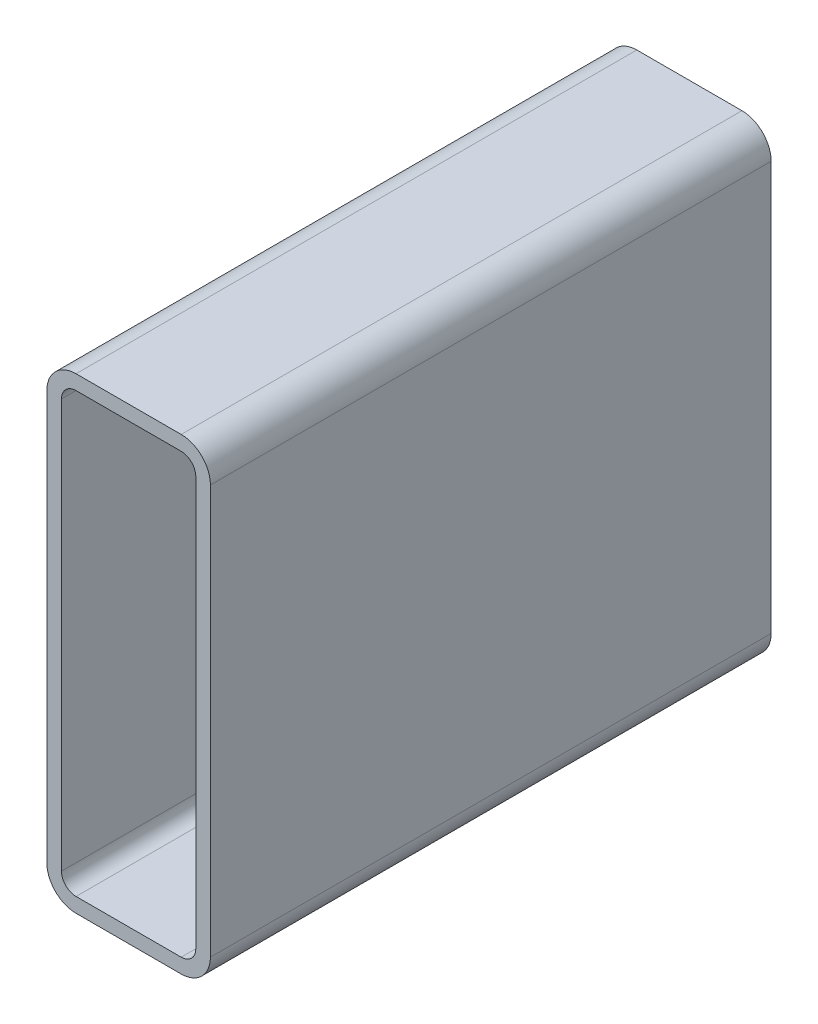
ISO-10303-21;
HEADER;
FILE_DESCRIPTION(('STEP AP214'),'2;1');
FILE_NAME('part.step','',(''),(''),'','','');
FILE_SCHEMA(('AUTOMOTIVE_DESIGN { 1 0 10303 214 1 1 1 1 }'));
ENDSEC;
DATA;
#1=APPLICATION_CONTEXT('core data for automotive mechanical design processes');
#2=APPLICATION_PROTOCOL_DEFINITION('international standard','automotive_design',2000,#1);
#3=PRODUCT_CONTEXT('',#1,'mechanical');
#4=PRODUCT('Part','Part','',(#3));
#5=PRODUCT_RELATED_PRODUCT_CATEGORY('part','',(#4));
#6=PRODUCT_DEFINITION_FORMATION('','',#4);
#7=PRODUCT_DEFINITION_CONTEXT('part definition',#1,'design');
#8=PRODUCT_DEFINITION('design','',#6,#7);
#9=PRODUCT_DEFINITION_SHAPE('','',#8);
#10=(LENGTH_UNIT() NAMED_UNIT(*) SI_UNIT(.MILLI.,.METRE.));
#11=(NAMED_UNIT(*) PLANE_ANGLE_UNIT() SI_UNIT($,.RADIAN.));
#12=(NAMED_UNIT(*) SI_UNIT($,.STERADIAN.) SOLID_ANGLE_UNIT());
#13=UNCERTAINTY_MEASURE_WITH_UNIT(LENGTH_MEASURE(1.E-05),#10,'distance_accuracy_value','');
#14=(GEOMETRIC_REPRESENTATION_CONTEXT(3) GLOBAL_UNCERTAINTY_ASSIGNED_CONTEXT((#13)) GLOBAL_UNIT_ASSIGNED_CONTEXT((#10,
#11,#12)) REPRESENTATION_CONTEXT('',''));
#15=CARTESIAN_POINT('',(0.,0.,0.));
#16=DIRECTION('',(0.,0.,1.));
#17=DIRECTION('',(1.,0.,0.));
#18=AXIS2_PLACEMENT_3D('',#15,#16,#17);
#19=CARTESIAN_POINT('',(17.9571469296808,240.045313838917,304.8));
#20=DIRECTION('',(0.,0.,1.));
#21=DIRECTION('',(1.,0.,0.));
#22=AXIS2_PLACEMENT_3D('',#19,#20,#21);
#23=PLANE('',#22);
#24=CARTESIAN_POINT('',(17.9571469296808,240.045313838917,304.8));
#25=DIRECTION('',(0.,0.,1.));
#26=DIRECTION('',(1.,0.,0.));
#27=AXIS2_PLACEMENT_3D('',#24,#25,#26);
#28=CIRCLE('',#27,15.875);
#29=CARTESIAN_POINT('',(17.9571469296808,255.920313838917,304.8));
#30=VERTEX_POINT('',#29);
#31=CARTESIAN_POINT('',(2.08214692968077,240.045313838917,304.8));
#32=VERTEX_POINT('',#31);
#33=EDGE_CURVE('E211',#30,#32,#28,.T.);
#34=ORIENTED_EDGE('',*,*,#33,.T.);
#35=DIRECTION('',(0.,-1.,0.));
#36=VECTOR('',#35,1.);
#37=CARTESIAN_POINT('',(2.08214692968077,17.7953138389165,304.8));
#38=LINE('',#37,#36);
#39=CARTESIAN_POINT('',(2.08214692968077,17.7953138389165,304.8));
#40=VERTEX_POINT('',#39);
#41=EDGE_CURVE('E214',#32,#40,#38,.T.);
#42=ORIENTED_EDGE('',*,*,#41,.T.);
#43=CARTESIAN_POINT('',(17.9571469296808,17.7953138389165,304.8));
#44=DIRECTION('',(0.,0.,1.));
#45=DIRECTION('',(1.,0.,0.));
#46=AXIS2_PLACEMENT_3D('',#43,#44,#45);
#47=CIRCLE('',#46,15.875);
#48=CARTESIAN_POINT('',(17.9571469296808,1.92031383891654,304.8));
#49=VERTEX_POINT('',#48);
#50=EDGE_CURVE('E217',#40,#49,#47,.T.);
#51=ORIENTED_EDGE('',*,*,#50,.T.);
#52=DIRECTION('',(1.,0.,0.));
#53=VECTOR('',#52,1.);
#54=CARTESIAN_POINT('',(75.1071469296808,1.92031383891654,304.8));
#55=LINE('',#54,#53);
#56=CARTESIAN_POINT('',(75.1071469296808,1.92031383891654,304.8));
#57=VERTEX_POINT('',#56);
#58=EDGE_CURVE('E219',#49,#57,#55,.T.);
#59=ORIENTED_EDGE('',*,*,#58,.T.);
#60=CARTESIAN_POINT('',(75.1071469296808,17.7953138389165,304.8));
#61=DIRECTION('',(0.,0.,1.));
#62=DIRECTION('',(1.,0.,0.));
#63=AXIS2_PLACEMENT_3D('',#60,#61,#62);
#64=CIRCLE('',#63,15.875);
#65=CARTESIAN_POINT('',(90.9821469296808,17.7953138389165,304.8));
#66=VERTEX_POINT('',#65);
#67=EDGE_CURVE('E221',#57,#66,#64,.T.);
#68=ORIENTED_EDGE('',*,*,#67,.T.);
#69=DIRECTION('',(0.,1.,0.));
#70=VECTOR('',#69,1.);
#71=CARTESIAN_POINT('',(90.9821469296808,240.045313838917,304.8));
#72=LINE('',#71,#70);
#73=CARTESIAN_POINT('',(90.9821469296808,240.045313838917,304.8));
#74=VERTEX_POINT('',#73);
#75=EDGE_CURVE('E223',#66,#74,#72,.T.);
#76=ORIENTED_EDGE('',*,*,#75,.T.);
#77=CARTESIAN_POINT('',(75.1071469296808,240.045313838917,304.8));
#78=DIRECTION('',(0.,0.,1.));
#79=DIRECTION('',(1.,0.,0.));
#80=AXIS2_PLACEMENT_3D('',#77,#78,#79);
#81=CIRCLE('',#80,15.875);
#82=CARTESIAN_POINT('',(75.1071469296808,255.920313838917,304.8));
#83=VERTEX_POINT('',#82);
#84=EDGE_CURVE('E225',#74,#83,#81,.T.);
#85=ORIENTED_EDGE('',*,*,#84,.T.);
#86=DIRECTION('',(-1.,0.,0.));
#87=VECTOR('',#86,1.);
#88=CARTESIAN_POINT('',(17.9571469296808,255.920313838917,304.8));
#89=LINE('',#88,#87);
#90=EDGE_CURVE('E227',#83,#30,#89,.T.);
#91=ORIENTED_EDGE('',*,*,#90,.T.);
#92=EDGE_LOOP('',(#34,#42,#51,#59,#68,#76,#85,#91));
#93=FACE_BOUND('',#92,.T.);
#94=DIRECTION('',(0.,-1.,0.));
#95=VECTOR('',#94,1.);
#96=CARTESIAN_POINT('',(10.0196469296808,17.7953138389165,304.8));
#97=LINE('',#96,#95);
#98=CARTESIAN_POINT('',(10.0196469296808,240.045313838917,304.8));
#99=VERTEX_POINT('',#98);
#100=CARTESIAN_POINT('',(10.0196469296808,17.7953138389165,304.8));
#101=VERTEX_POINT('',#100);
#102=EDGE_CURVE('E154',#99,#101,#97,.T.);
#103=ORIENTED_EDGE('',*,*,#102,.F.);
#104=CARTESIAN_POINT('',(17.9571469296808,240.045313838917,304.8));
#105=DIRECTION('',(0.,0.,1.));
#106=DIRECTION('',(1.,0.,0.));
#107=AXIS2_PLACEMENT_3D('',#104,#105,#106);
#108=CIRCLE('',#107,7.9375);
#109=CARTESIAN_POINT('',(17.9571469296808,247.982813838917,304.8));
#110=VERTEX_POINT('',#109);
#111=EDGE_CURVE('E146',#110,#99,#108,.T.);
#112=ORIENTED_EDGE('',*,*,#111,.F.);
#113=DIRECTION('',(-1.,0.,0.));
#114=VECTOR('',#113,1.);
#115=CARTESIAN_POINT('',(17.9571469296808,247.982813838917,304.8));
#116=LINE('',#115,#114);
#117=CARTESIAN_POINT('',(75.1071469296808,247.982813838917,304.8));
#118=VERTEX_POINT('',#117);
#119=EDGE_CURVE('E179',#118,#110,#116,.T.);
#120=ORIENTED_EDGE('',*,*,#119,.F.);
#121=CARTESIAN_POINT('',(75.1071469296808,240.045313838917,304.8));
#122=DIRECTION('',(0.,0.,1.));
#123=DIRECTION('',(1.,0.,0.));
#124=AXIS2_PLACEMENT_3D('',#121,#122,#123);
#125=CIRCLE('',#124,7.93749999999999);
#126=CARTESIAN_POINT('',(83.0446469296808,240.045313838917,304.8));
#127=VERTEX_POINT('',#126);
#128=EDGE_CURVE('E177',#127,#118,#125,.T.);
#129=ORIENTED_EDGE('',*,*,#128,.F.);
#130=DIRECTION('',(0.,1.,0.));
#131=VECTOR('',#130,1.);
#132=CARTESIAN_POINT('',(83.0446469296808,240.045313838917,304.8));
#133=LINE('',#132,#131);
#134=CARTESIAN_POINT('',(83.0446469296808,17.7953138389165,304.8));
#135=VERTEX_POINT('',#134);
#136=EDGE_CURVE('E175',#135,#127,#133,.T.);
#137=ORIENTED_EDGE('',*,*,#136,.F.);
#138=CARTESIAN_POINT('',(75.1071469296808,17.7953138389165,304.8));
#139=DIRECTION('',(0.,0.,1.));
#140=DIRECTION('',(1.,0.,0.));
#141=AXIS2_PLACEMENT_3D('',#138,#139,#140);
#142=CIRCLE('',#141,7.9375);
#143=CARTESIAN_POINT('',(75.1071469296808,9.85781383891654,304.8));
#144=VERTEX_POINT('',#143);
#145=EDGE_CURVE('E173',#144,#135,#142,.T.);
#146=ORIENTED_EDGE('',*,*,#145,.F.);
#147=DIRECTION('',(1.,0.,0.));
#148=VECTOR('',#147,1.);
#149=CARTESIAN_POINT('',(75.1071469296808,9.85781383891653,304.8));
#150=LINE('',#149,#148);
#151=CARTESIAN_POINT('',(17.9571469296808,9.85781383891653,304.8));
#152=VERTEX_POINT('',#151);
#153=EDGE_CURVE('E169',#152,#144,#150,.T.);
#154=ORIENTED_EDGE('',*,*,#153,.F.);
#155=CARTESIAN_POINT('',(17.9571469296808,17.7953138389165,304.8));
#156=DIRECTION('',(0.,0.,1.));
#157=DIRECTION('',(1.,0.,0.));
#158=AXIS2_PLACEMENT_3D('',#155,#156,#157);
#159=CIRCLE('',#158,7.9375);
#160=EDGE_CURVE('E167',#101,#152,#159,.T.);
#161=ORIENTED_EDGE('',*,*,#160,.F.);
#162=EDGE_LOOP('',(#103,#112,#120,#129,#137,#146,#154,#161));
#163=FACE_BOUND('',#162,.T.);
#164=ADVANCED_FACE('F33',(#93,#163),#23,.T.);
#165=CARTESIAN_POINT('',(17.9571469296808,240.045313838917,0.));
#166=DIRECTION('',(0.,0.,1.));
#167=DIRECTION('',(1.,0.,0.));
#168=AXIS2_PLACEMENT_3D('',#165,#166,#167);
#169=PLANE('',#168);
#170=CARTESIAN_POINT('',(17.9571469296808,240.045313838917,0.));
#171=DIRECTION('',(0.,0.,1.));
#172=DIRECTION('',(1.,0.,0.));
#173=AXIS2_PLACEMENT_3D('',#170,#171,#172);
#174=CIRCLE('',#173,15.875);
#175=CARTESIAN_POINT('',(17.9571469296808,255.920313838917,0.));
#176=VERTEX_POINT('',#175);
#177=CARTESIAN_POINT('',(2.08214692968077,240.045313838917,0.));
#178=VERTEX_POINT('',#177);
#179=EDGE_CURVE('E162',#176,#178,#174,.T.);
#180=ORIENTED_EDGE('',*,*,#179,.F.);
#181=DIRECTION('',(-1.,0.,0.));
#182=VECTOR('',#181,1.);
#183=CARTESIAN_POINT('',(17.9571469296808,255.920313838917,0.));
#184=LINE('',#183,#182);
#185=CARTESIAN_POINT('',(75.1071469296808,255.920313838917,0.));
#186=VERTEX_POINT('',#185);
#187=EDGE_CURVE('E215',#186,#176,#184,.T.);
#188=ORIENTED_EDGE('',*,*,#187,.F.);
#189=CARTESIAN_POINT('',(75.1071469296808,240.045313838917,0.));
#190=DIRECTION('',(0.,0.,1.));
#191=DIRECTION('',(1.,0.,0.));
#192=AXIS2_PLACEMENT_3D('',#189,#190,#191);
#193=CIRCLE('',#192,15.875);
#194=CARTESIAN_POINT('',(90.9821469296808,240.045313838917,0.));
#195=VERTEX_POINT('',#194);
#196=EDGE_CURVE('E242',#195,#186,#193,.T.);
#197=ORIENTED_EDGE('',*,*,#196,.F.);
#198=DIRECTION('',(0.,1.,0.));
#199=VECTOR('',#198,1.);
#200=CARTESIAN_POINT('',(90.9821469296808,240.045313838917,0.));
#201=LINE('',#200,#199);
#202=CARTESIAN_POINT('',(90.9821469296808,17.7953138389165,0.));
#203=VERTEX_POINT('',#202);
#204=EDGE_CURVE('E240',#203,#195,#201,.T.);
#205=ORIENTED_EDGE('',*,*,#204,.F.);
#206=CARTESIAN_POINT('',(75.1071469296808,17.7953138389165,0.));
#207=DIRECTION('',(0.,0.,1.));
#208=DIRECTION('',(1.,0.,0.));
#209=AXIS2_PLACEMENT_3D('',#206,#207,#208);
#210=CIRCLE('',#209,15.875);
#211=CARTESIAN_POINT('',(75.1071469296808,1.92031383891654,0.));
#212=VERTEX_POINT('',#211);
#213=EDGE_CURVE('E238',#212,#203,#210,.T.);
#214=ORIENTED_EDGE('',*,*,#213,.F.);
#215=DIRECTION('',(1.,0.,0.));
#216=VECTOR('',#215,1.);
#217=CARTESIAN_POINT('',(75.1071469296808,1.92031383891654,0.));
#218=LINE('',#217,#216);
#219=CARTESIAN_POINT('',(17.9571469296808,1.92031383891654,0.));
#220=VERTEX_POINT('',#219);
#221=EDGE_CURVE('E236',#220,#212,#218,.T.);
#222=ORIENTED_EDGE('',*,*,#221,.F.);
#223=CARTESIAN_POINT('',(17.9571469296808,17.7953138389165,0.));
#224=DIRECTION('',(0.,0.,1.));
#225=DIRECTION('',(1.,0.,0.));
#226=AXIS2_PLACEMENT_3D('',#223,#224,#225);
#227=CIRCLE('',#226,15.875);
#228=CARTESIAN_POINT('',(2.08214692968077,17.7953138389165,0.));
#229=VERTEX_POINT('',#228);
#230=EDGE_CURVE('E234',#229,#220,#227,.T.);
#231=ORIENTED_EDGE('',*,*,#230,.F.);
#232=DIRECTION('',(0.,-1.,0.));
#233=VECTOR('',#232,1.);
#234=CARTESIAN_POINT('',(2.08214692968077,17.7953138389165,0.));
#235=LINE('',#234,#233);
#236=EDGE_CURVE('E232',#178,#229,#235,.T.);
#237=ORIENTED_EDGE('',*,*,#236,.F.);
#238=EDGE_LOOP('',(#180,#188,#197,#205,#214,#222,#231,#237));
#239=FACE_BOUND('',#238,.T.);
#240=CARTESIAN_POINT('',(17.9571469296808,240.045313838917,0.));
#241=DIRECTION('',(0.,0.,1.));
#242=DIRECTION('',(1.,0.,0.));
#243=AXIS2_PLACEMENT_3D('',#240,#241,#242);
#244=CIRCLE('',#243,7.9375);
#245=CARTESIAN_POINT('',(17.9571469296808,247.982813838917,0.));
#246=VERTEX_POINT('',#245);
#247=CARTESIAN_POINT('',(10.0196469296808,240.045313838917,0.));
#248=VERTEX_POINT('',#247);
#249=EDGE_CURVE('E56',#246,#248,#244,.T.);
#250=ORIENTED_EDGE('',*,*,#249,.T.);
#251=DIRECTION('',(0.,-1.,0.));
#252=VECTOR('',#251,1.);
#253=CARTESIAN_POINT('',(10.0196469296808,17.7953138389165,0.));
#254=LINE('',#253,#252);
#255=CARTESIAN_POINT('',(10.0196469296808,17.7953138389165,0.));
#256=VERTEX_POINT('',#255);
#257=EDGE_CURVE('E161',#248,#256,#254,.T.);
#258=ORIENTED_EDGE('',*,*,#257,.T.);
#259=CARTESIAN_POINT('',(17.9571469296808,17.7953138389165,0.));
#260=DIRECTION('',(0.,0.,1.));
#261=DIRECTION('',(1.,0.,0.));
#262=AXIS2_PLACEMENT_3D('',#259,#260,#261);
#263=CIRCLE('',#262,7.9375);
#264=CARTESIAN_POINT('',(17.9571469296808,9.85781383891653,0.));
#265=VERTEX_POINT('',#264);
#266=EDGE_CURVE('E183',#256,#265,#263,.T.);
#267=ORIENTED_EDGE('',*,*,#266,.T.);
#268=DIRECTION('',(1.,0.,0.));
#269=VECTOR('',#268,1.);
#270=CARTESIAN_POINT('',(75.1071469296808,9.85781383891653,0.));
#271=LINE('',#270,#269);
#272=CARTESIAN_POINT('',(75.1071469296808,9.85781383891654,0.));
#273=VERTEX_POINT('',#272);
#274=EDGE_CURVE('E186',#265,#273,#271,.T.);
#275=ORIENTED_EDGE('',*,*,#274,.T.);
#276=CARTESIAN_POINT('',(75.1071469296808,17.7953138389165,0.));
#277=DIRECTION('',(0.,0.,1.));
#278=DIRECTION('',(1.,0.,0.));
#279=AXIS2_PLACEMENT_3D('',#276,#277,#278);
#280=CIRCLE('',#279,7.9375);
#281=CARTESIAN_POINT('',(83.0446469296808,17.7953138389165,0.));
#282=VERTEX_POINT('',#281);
#283=EDGE_CURVE('E189',#273,#282,#280,.T.);
#284=ORIENTED_EDGE('',*,*,#283,.T.);
#285=DIRECTION('',(0.,1.,0.));
#286=VECTOR('',#285,1.);
#287=CARTESIAN_POINT('',(83.0446469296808,240.045313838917,0.));
#288=LINE('',#287,#286);
#289=CARTESIAN_POINT('',(83.0446469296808,240.045313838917,0.));
#290=VERTEX_POINT('',#289);
#291=EDGE_CURVE('E192',#282,#290,#288,.T.);
#292=ORIENTED_EDGE('',*,*,#291,.T.);
#293=CARTESIAN_POINT('',(75.1071469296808,240.045313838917,0.));
#294=DIRECTION('',(0.,0.,1.));
#295=DIRECTION('',(1.,0.,0.));
#296=AXIS2_PLACEMENT_3D('',#293,#294,#295);
#297=CIRCLE('',#296,7.93749999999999);
#298=CARTESIAN_POINT('',(75.1071469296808,247.982813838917,0.));
#299=VERTEX_POINT('',#298);
#300=EDGE_CURVE('E195',#290,#299,#297,.T.);
#301=ORIENTED_EDGE('',*,*,#300,.T.);
#302=DIRECTION('',(-1.,0.,0.));
#303=VECTOR('',#302,1.);
#304=CARTESIAN_POINT('',(17.9571469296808,247.982813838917,0.));
#305=LINE('',#304,#303);
#306=EDGE_CURVE('E155',#299,#246,#305,.T.);
#307=ORIENTED_EDGE('',*,*,#306,.T.);
#308=EDGE_LOOP('',(#250,#258,#267,#275,#284,#292,#301,#307));
#309=FACE_BOUND('',#308,.T.);
#310=ADVANCED_FACE('F272',(#239,#309),#169,.F.);
#311=CARTESIAN_POINT('',(17.9571469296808,240.045313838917,304.8));
#312=DIRECTION('',(0.,0.,-1.));
#313=DIRECTION('',(-1.,0.,0.));
#314=AXIS2_PLACEMENT_3D('',#311,#312,#313);
#315=CYLINDRICAL_SURFACE('',#314,15.875);
#316=ORIENTED_EDGE('',*,*,#179,.T.);
#317=DIRECTION('',(0.,0.,-1.));
#318=VECTOR('',#317,1.);
#319=CARTESIAN_POINT('',(2.08214692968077,240.045313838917,304.8));
#320=LINE('',#319,#318);
#321=EDGE_CURVE('E11',#32,#178,#320,.T.);
#322=ORIENTED_EDGE('',*,*,#321,.F.);
#323=ORIENTED_EDGE('',*,*,#33,.F.);
#324=DIRECTION('',(0.,0.,-1.));
#325=VECTOR('',#324,1.);
#326=CARTESIAN_POINT('',(17.9571469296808,255.920313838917,304.8));
#327=LINE('',#326,#325);
#328=EDGE_CURVE('E229',#30,#176,#327,.T.);
#329=ORIENTED_EDGE('',*,*,#328,.T.);
#330=EDGE_LOOP('',(#316,#322,#323,#329));
#331=FACE_BOUND('',#330,.T.);
#332=ADVANCED_FACE('F35',(#331),#315,.T.);
#333=CARTESIAN_POINT('',(2.08214692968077,17.7953138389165,304.8));
#334=DIRECTION('',(1.,0.,0.));
#335=DIRECTION('',(0.,0.,-1.));
#336=AXIS2_PLACEMENT_3D('',#333,#334,#335);
#337=PLANE('',#336);
#338=ORIENTED_EDGE('',*,*,#236,.T.);
#339=DIRECTION('',(0.,0.,-1.));
#340=VECTOR('',#339,1.);
#341=CARTESIAN_POINT('',(2.08214692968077,17.7953138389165,304.8));
#342=LINE('',#341,#340);
#343=EDGE_CURVE('E41',#40,#229,#342,.T.);
#344=ORIENTED_EDGE('',*,*,#343,.F.);
#345=ORIENTED_EDGE('',*,*,#41,.F.);
#346=ORIENTED_EDGE('',*,*,#321,.T.);
#347=EDGE_LOOP('',(#338,#344,#345,#346));
#348=FACE_BOUND('',#347,.T.);
#349=ADVANCED_FACE('F289',(#348),#337,.F.);
#350=CARTESIAN_POINT('',(17.9571469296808,17.7953138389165,304.8));
#351=DIRECTION('',(0.,0.,-1.));
#352=DIRECTION('',(-1.,0.,0.));
#353=AXIS2_PLACEMENT_3D('',#350,#351,#352);
#354=CYLINDRICAL_SURFACE('',#353,15.875);
#355=ORIENTED_EDGE('',*,*,#230,.T.);
#356=DIRECTION('',(0.,0.,-1.));
#357=VECTOR('',#356,1.);
#358=CARTESIAN_POINT('',(17.9571469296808,1.92031383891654,304.8));
#359=LINE('',#358,#357);
#360=EDGE_CURVE('E259',#49,#220,#359,.T.);
#361=ORIENTED_EDGE('',*,*,#360,.F.);
#362=ORIENTED_EDGE('',*,*,#50,.F.);
#363=ORIENTED_EDGE('',*,*,#343,.T.);
#364=EDGE_LOOP('',(#355,#361,#362,#363));
#365=FACE_BOUND('',#364,.T.);
#366=ADVANCED_FACE('F266',(#365),#354,.T.);
#367=CARTESIAN_POINT('',(75.1071469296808,1.92031383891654,304.8));
#368=DIRECTION('',(0.,1.,0.));
#369=DIRECTION('',(0.,0.,1.));
#370=AXIS2_PLACEMENT_3D('',#367,#368,#369);
#371=PLANE('',#370);
#372=ORIENTED_EDGE('',*,*,#221,.T.);
#373=DIRECTION('',(0.,0.,-1.));
#374=VECTOR('',#373,1.);
#375=CARTESIAN_POINT('',(75.1071469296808,1.92031383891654,304.8));
#376=LINE('',#375,#374);
#377=EDGE_CURVE('E256',#57,#212,#376,.T.);
#378=ORIENTED_EDGE('',*,*,#377,.F.);
#379=ORIENTED_EDGE('',*,*,#58,.F.);
#380=ORIENTED_EDGE('',*,*,#360,.T.);
#381=EDGE_LOOP('',(#372,#378,#379,#380));
#382=FACE_BOUND('',#381,.T.);
#383=ADVANCED_FACE('F278',(#382),#371,.F.);
#384=CARTESIAN_POINT('',(75.1071469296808,17.7953138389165,304.8));
#385=DIRECTION('',(0.,0.,-1.));
#386=DIRECTION('',(-1.,0.,0.));
#387=AXIS2_PLACEMENT_3D('',#384,#385,#386);
#388=CYLINDRICAL_SURFACE('',#387,15.875);
#389=ORIENTED_EDGE('',*,*,#213,.T.);
#390=DIRECTION('',(0.,0.,-1.));
#391=VECTOR('',#390,1.);
#392=CARTESIAN_POINT('',(90.9821469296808,17.7953138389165,304.8));
#393=LINE('',#392,#391);
#394=EDGE_CURVE('E253',#66,#203,#393,.T.);
#395=ORIENTED_EDGE('',*,*,#394,.F.);
#396=ORIENTED_EDGE('',*,*,#67,.F.);
#397=ORIENTED_EDGE('',*,*,#377,.T.);
#398=EDGE_LOOP('',(#389,#395,#396,#397));
#399=FACE_BOUND('',#398,.T.);
#400=ADVANCED_FACE('F282',(#399),#388,.T.);
#401=CARTESIAN_POINT('',(90.9821469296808,240.045313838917,304.8));
#402=DIRECTION('',(-1.,0.,0.));
#403=DIRECTION('',(0.,0.,1.));
#404=AXIS2_PLACEMENT_3D('',#401,#402,#403);
#405=PLANE('',#404);
#406=ORIENTED_EDGE('',*,*,#204,.T.);
#407=DIRECTION('',(0.,0.,-1.));
#408=VECTOR('',#407,1.);
#409=CARTESIAN_POINT('',(90.9821469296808,240.045313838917,304.8));
#410=LINE('',#409,#408);
#411=EDGE_CURVE('E250',#74,#195,#410,.T.);
#412=ORIENTED_EDGE('',*,*,#411,.F.);
#413=ORIENTED_EDGE('',*,*,#75,.F.);
#414=ORIENTED_EDGE('',*,*,#394,.T.);
#415=EDGE_LOOP('',(#406,#412,#413,#414));
#416=FACE_BOUND('',#415,.T.);
#417=ADVANCED_FACE('F302',(#416),#405,.F.);
#418=CARTESIAN_POINT('',(75.1071469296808,240.045313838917,304.8));
#419=DIRECTION('',(0.,0.,-1.));
#420=DIRECTION('',(-1.,0.,0.));
#421=AXIS2_PLACEMENT_3D('',#418,#419,#420);
#422=CYLINDRICAL_SURFACE('',#421,15.875);
#423=ORIENTED_EDGE('',*,*,#196,.T.);
#424=DIRECTION('',(0.,0.,-1.));
#425=VECTOR('',#424,1.);
#426=CARTESIAN_POINT('',(75.1071469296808,255.920313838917,304.8));
#427=LINE('',#426,#425);
#428=EDGE_CURVE('E247',#83,#186,#427,.T.);
#429=ORIENTED_EDGE('',*,*,#428,.F.);
#430=ORIENTED_EDGE('',*,*,#84,.F.);
#431=ORIENTED_EDGE('',*,*,#411,.T.);
#432=EDGE_LOOP('',(#423,#429,#430,#431));
#433=FACE_BOUND('',#432,.T.);
#434=ADVANCED_FACE('F300',(#433),#422,.T.);
#435=CARTESIAN_POINT('',(17.9571469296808,255.920313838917,304.8));
#436=DIRECTION('',(0.,-1.,0.));
#437=DIRECTION('',(0.,0.,-1.));
#438=AXIS2_PLACEMENT_3D('',#435,#436,#437);
#439=PLANE('',#438);
#440=ORIENTED_EDGE('',*,*,#187,.T.);
#441=ORIENTED_EDGE('',*,*,#328,.F.);
#442=ORIENTED_EDGE('',*,*,#90,.F.);
#443=ORIENTED_EDGE('',*,*,#428,.T.);
#444=EDGE_LOOP('',(#440,#441,#442,#443));
#445=FACE_BOUND('',#444,.T.);
#446=ADVANCED_FACE('F295',(#445),#439,.F.);
#447=CARTESIAN_POINT('',(17.9571469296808,240.045313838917,304.8));
#448=DIRECTION('',(0.,0.,-1.));
#449=DIRECTION('',(-1.,0.,0.));
#450=AXIS2_PLACEMENT_3D('',#447,#448,#449);
#451=CYLINDRICAL_SURFACE('',#450,7.9375);
#452=ORIENTED_EDGE('',*,*,#249,.F.);
#453=DIRECTION('',(0.,0.,-1.));
#454=VECTOR('',#453,1.);
#455=CARTESIAN_POINT('',(17.9571469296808,247.982813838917,304.8));
#456=LINE('',#455,#454);
#457=EDGE_CURVE('E150',#110,#246,#456,.T.);
#458=ORIENTED_EDGE('',*,*,#457,.F.);
#459=ORIENTED_EDGE('',*,*,#111,.T.);
#460=DIRECTION('',(0.,0.,-1.));
#461=VECTOR('',#460,1.);
#462=CARTESIAN_POINT('',(10.0196469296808,240.045313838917,304.8));
#463=LINE('',#462,#461);
#464=EDGE_CURVE('E149',#99,#248,#463,.T.);
#465=ORIENTED_EDGE('',*,*,#464,.T.);
#466=EDGE_LOOP('',(#452,#458,#459,#465));
#467=FACE_BOUND('',#466,.T.);
#468=ADVANCED_FACE('F148',(#467),#451,.F.);
#469=CARTESIAN_POINT('',(10.0196469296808,17.7953138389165,304.8));
#470=DIRECTION('',(1.,0.,0.));
#471=DIRECTION('',(0.,0.,-1.));
#472=AXIS2_PLACEMENT_3D('',#469,#470,#471);
#473=PLANE('',#472);
#474=ORIENTED_EDGE('',*,*,#257,.F.);
#475=ORIENTED_EDGE('',*,*,#464,.F.);
#476=ORIENTED_EDGE('',*,*,#102,.T.);
#477=DIRECTION('',(0.,0.,-1.));
#478=VECTOR('',#477,1.);
#479=CARTESIAN_POINT('',(10.0196469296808,17.7953138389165,304.8));
#480=LINE('',#479,#478);
#481=EDGE_CURVE('E163',#101,#256,#480,.T.);
#482=ORIENTED_EDGE('',*,*,#481,.T.);
#483=EDGE_LOOP('',(#474,#475,#476,#482));
#484=FACE_BOUND('',#483,.T.);
#485=ADVANCED_FACE('F158',(#484),#473,.T.);
#486=CARTESIAN_POINT('',(17.9571469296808,17.7953138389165,304.8));
#487=DIRECTION('',(0.,0.,-1.));
#488=DIRECTION('',(-1.,0.,0.));
#489=AXIS2_PLACEMENT_3D('',#486,#487,#488);
#490=CYLINDRICAL_SURFACE('',#489,7.9375);
#491=ORIENTED_EDGE('',*,*,#266,.F.);
#492=ORIENTED_EDGE('',*,*,#481,.F.);
#493=ORIENTED_EDGE('',*,*,#160,.T.);
#494=DIRECTION('',(0.,0.,-1.));
#495=VECTOR('',#494,1.);
#496=CARTESIAN_POINT('',(17.9571469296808,9.85781383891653,304.8));
#497=LINE('',#496,#495);
#498=EDGE_CURVE('E208',#152,#265,#497,.T.);
#499=ORIENTED_EDGE('',*,*,#498,.T.);
#500=EDGE_LOOP('',(#491,#492,#493,#499));
#501=FACE_BOUND('',#500,.T.);
#502=ADVANCED_FACE('F327',(#501),#490,.F.);
#503=CARTESIAN_POINT('',(75.1071469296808,9.85781383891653,304.8));
#504=DIRECTION('',(0.,1.,0.));
#505=DIRECTION('',(0.,0.,1.));
#506=AXIS2_PLACEMENT_3D('',#503,#504,#505);
#507=PLANE('',#506);
#508=ORIENTED_EDGE('',*,*,#274,.F.);
#509=ORIENTED_EDGE('',*,*,#498,.F.);
#510=ORIENTED_EDGE('',*,*,#153,.T.);
#511=DIRECTION('',(0.,0.,-1.));
#512=VECTOR('',#511,1.);
#513=CARTESIAN_POINT('',(75.1071469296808,9.85781383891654,304.8));
#514=LINE('',#513,#512);
#515=EDGE_CURVE('E206',#144,#273,#514,.T.);
#516=ORIENTED_EDGE('',*,*,#515,.T.);
#517=EDGE_LOOP('',(#508,#509,#510,#516));
#518=FACE_BOUND('',#517,.T.);
#519=ADVANCED_FACE('F331',(#518),#507,.T.);
#520=CARTESIAN_POINT('',(75.1071469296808,17.7953138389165,304.8));
#521=DIRECTION('',(0.,0.,-1.));
#522=DIRECTION('',(-1.,0.,0.));
#523=AXIS2_PLACEMENT_3D('',#520,#521,#522);
#524=CYLINDRICAL_SURFACE('',#523,7.9375);
#525=ORIENTED_EDGE('',*,*,#283,.F.);
#526=ORIENTED_EDGE('',*,*,#515,.F.);
#527=ORIENTED_EDGE('',*,*,#145,.T.);
#528=DIRECTION('',(0.,0.,-1.));
#529=VECTOR('',#528,1.);
#530=CARTESIAN_POINT('',(83.0446469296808,17.7953138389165,304.8));
#531=LINE('',#530,#529);
#532=EDGE_CURVE('E204',#135,#282,#531,.T.);
#533=ORIENTED_EDGE('',*,*,#532,.T.);
#534=EDGE_LOOP('',(#525,#526,#527,#533));
#535=FACE_BOUND('',#534,.T.);
#536=ADVANCED_FACE('F337',(#535),#524,.F.);
#537=CARTESIAN_POINT('',(83.0446469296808,240.045313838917,304.8));
#538=DIRECTION('',(-1.,0.,0.));
#539=DIRECTION('',(0.,0.,1.));
#540=AXIS2_PLACEMENT_3D('',#537,#538,#539);
#541=PLANE('',#540);
#542=ORIENTED_EDGE('',*,*,#291,.F.);
#543=ORIENTED_EDGE('',*,*,#532,.F.);
#544=ORIENTED_EDGE('',*,*,#136,.T.);
#545=DIRECTION('',(0.,0.,-1.));
#546=VECTOR('',#545,1.);
#547=CARTESIAN_POINT('',(83.0446469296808,240.045313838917,304.8));
#548=LINE('',#547,#546);
#549=EDGE_CURVE('E202',#127,#290,#548,.T.);
#550=ORIENTED_EDGE('',*,*,#549,.T.);
#551=EDGE_LOOP('',(#542,#543,#544,#550));
#552=FACE_BOUND('',#551,.T.);
#553=ADVANCED_FACE('F341',(#552),#541,.T.);
#554=CARTESIAN_POINT('',(75.1071469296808,240.045313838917,304.8));
#555=DIRECTION('',(0.,0.,-1.));
#556=DIRECTION('',(-1.,0.,0.));
#557=AXIS2_PLACEMENT_3D('',#554,#555,#556);
#558=CYLINDRICAL_SURFACE('',#557,7.93749999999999);
#559=ORIENTED_EDGE('',*,*,#300,.F.);
#560=ORIENTED_EDGE('',*,*,#549,.F.);
#561=ORIENTED_EDGE('',*,*,#128,.T.);
#562=DIRECTION('',(0.,0.,-1.));
#563=VECTOR('',#562,1.);
#564=CARTESIAN_POINT('',(75.1071469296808,247.982813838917,304.8));
#565=LINE('',#564,#563);
#566=EDGE_CURVE('E48',#118,#299,#565,.T.);
#567=ORIENTED_EDGE('',*,*,#566,.T.);
#568=EDGE_LOOP('',(#559,#560,#561,#567));
#569=FACE_BOUND('',#568,.T.);
#570=ADVANCED_FACE('F345',(#569),#558,.F.);
#571=CARTESIAN_POINT('',(17.9571469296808,247.982813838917,304.8));
#572=DIRECTION('',(0.,-1.,0.));
#573=DIRECTION('',(0.,0.,-1.));
#574=AXIS2_PLACEMENT_3D('',#571,#572,#573);
#575=PLANE('',#574);
#576=ORIENTED_EDGE('',*,*,#306,.F.);
#577=ORIENTED_EDGE('',*,*,#566,.F.);
#578=ORIENTED_EDGE('',*,*,#119,.T.);
#579=ORIENTED_EDGE('',*,*,#457,.T.);
#580=EDGE_LOOP('',(#576,#577,#578,#579));
#581=FACE_BOUND('',#580,.T.);
#582=ADVANCED_FACE('F349',(#581),#575,.T.);
#583=CLOSED_SHELL('',(#164,#310,#332,#349,#366,#383,#400,#417,#434,#446,#468,#485,#502,#519,
#536,#553,#570,#582));
#584=MANIFOLD_SOLID_BREP('B2',#583);
#585=ADVANCED_BREP_SHAPE_REPRESENTATION('',(#18,#584),#14);
#586=SHAPE_DEFINITION_REPRESENTATION(#9,#585);
ENDSEC;
END-ISO-10303-21;
